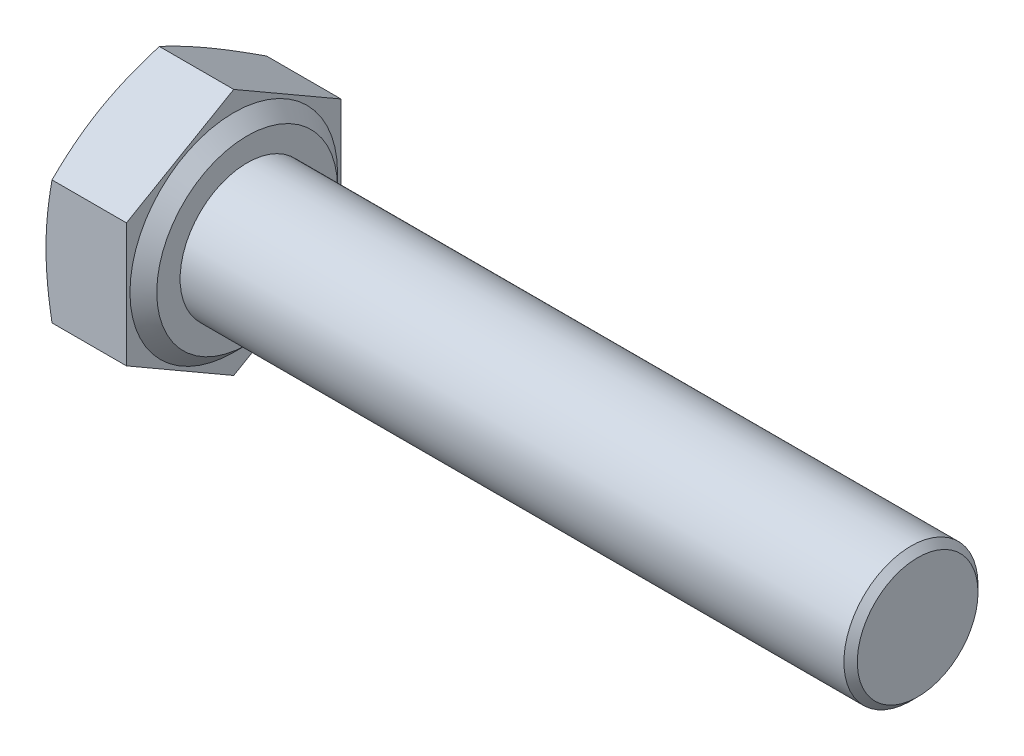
from build123d import *

# Parameters (mm, degrees)
BASEHEAD_DEPTH = 3.5
SKETCH5_R      = 2.5
BASEBODY_DEPTH = 25
CHAMFER1_SIZE  = 0.25


with BuildPart() as part:
    # Sketch2 → BaseHead (new body)
    with BuildSketch(Plane(origin=(0, 0, 0), x_dir=(0, 0, -1), z_dir=(1, 0, 0))):
        Polygon((0, -4.618802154), (4, -2.309401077), (4, 2.309401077), (0, 4.618802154), (-4, 2.309401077), (-4, -2.309401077), align=None)
    extrude(amount=BASEHEAD_DEPTH)

    # Sketch3 → BearingFace (revolve, cut)
    with BuildSketch(Plane.XY, mode=Mode.PRIVATE) as bearingface_sk:
        Polygon((3.5, 4.618802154), (3.5, 3.37), (3, 3.87), (3, 4.618802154), align=None)
    revolve(bearingface_sk.sketch.rotate(Axis((-0.957090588, 0, 0), (1, 0, 0)), 90), axis=Axis((-0.957090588, 0, 0), (1, 0, 0)), mode=Mode.SUBTRACT)

    # Sketch4 → HeadChamfer (revolve, cut)
    with BuildSketch(Plane.XY):
        Polygon((0, 4.618802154), (0.225225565, 4.618802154), (0, 4), align=None)
    revolve(axis=Axis((-0.493528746, 0, 0), (1, 0, 0)), mode=Mode.SUBTRACT)

    # Sketch5 → BaseBody (add)
    with BuildSketch(Plane(origin=(3.5, 0, 0), x_dir=(0, 0, -1), z_dir=(1, 0, 0))):
        Circle(SKETCH5_R)
    extrude(amount=BASEBODY_DEPTH)

    # Chamfer1
    chamfer1_edges = [part.edges().sort_by_distance(p)[0] for p in [
        (28.5, 0, 2.5),
    ]]
    chamfer(chamfer1_edges, length=CHAMFER1_SIZE)


solid = part.part
